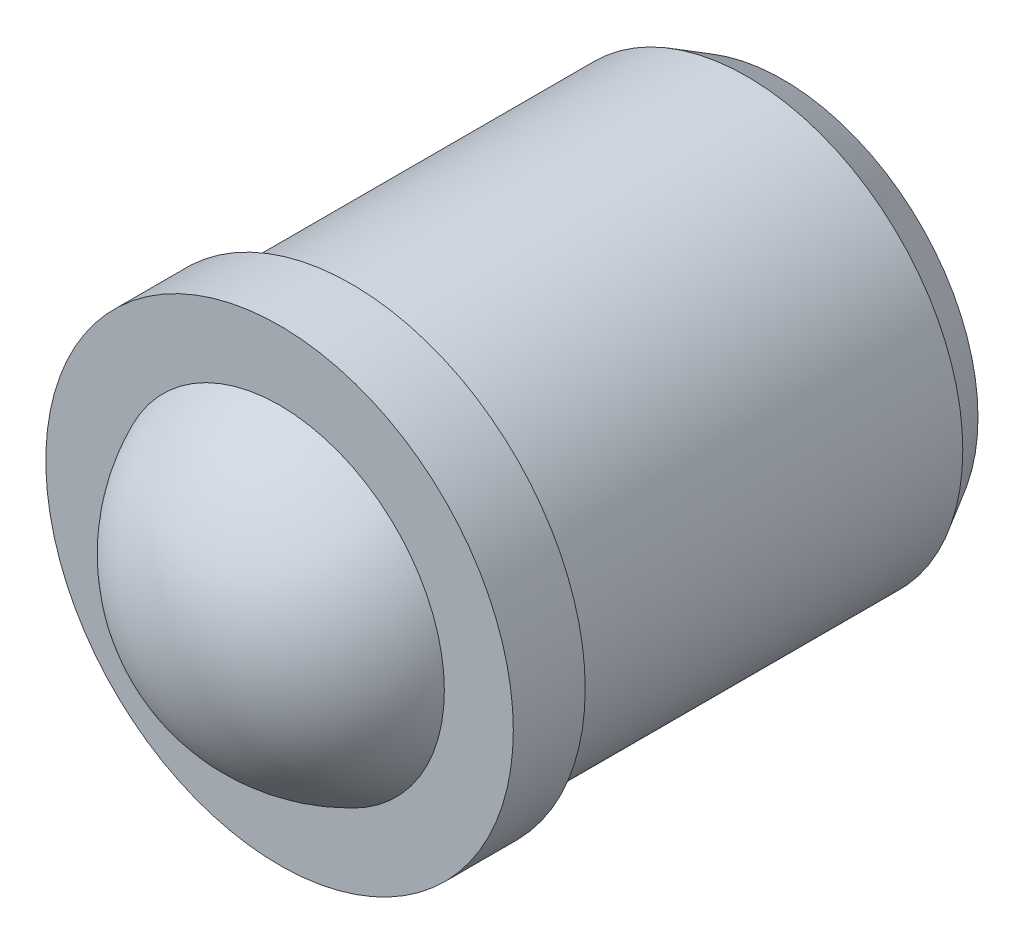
ISO-10303-21;
HEADER;
FILE_DESCRIPTION(('STEP AP214'),'2;1');
FILE_NAME('part.step','',(''),(''),'','','');
FILE_SCHEMA(('AUTOMOTIVE_DESIGN { 1 0 10303 214 1 1 1 1 }'));
ENDSEC;
DATA;
#1=APPLICATION_CONTEXT('core data for automotive mechanical design processes');
#2=APPLICATION_PROTOCOL_DEFINITION('international standard','automotive_design',2000,#1);
#3=PRODUCT_CONTEXT('',#1,'mechanical');
#4=PRODUCT('Part','Part','',(#3));
#5=PRODUCT_RELATED_PRODUCT_CATEGORY('part','',(#4));
#6=PRODUCT_DEFINITION_FORMATION('','',#4);
#7=PRODUCT_DEFINITION_CONTEXT('part definition',#1,'design');
#8=PRODUCT_DEFINITION('design','',#6,#7);
#9=PRODUCT_DEFINITION_SHAPE('','',#8);
#10=(LENGTH_UNIT() NAMED_UNIT(*) SI_UNIT(.MILLI.,.METRE.));
#11=(NAMED_UNIT(*) PLANE_ANGLE_UNIT() SI_UNIT($,.RADIAN.));
#12=(NAMED_UNIT(*) SI_UNIT($,.STERADIAN.) SOLID_ANGLE_UNIT());
#13=UNCERTAINTY_MEASURE_WITH_UNIT(LENGTH_MEASURE(1.E-05),#10,'distance_accuracy_value','');
#14=(GEOMETRIC_REPRESENTATION_CONTEXT(3) GLOBAL_UNCERTAINTY_ASSIGNED_CONTEXT((#13)) GLOBAL_UNIT_ASSIGNED_CONTEXT((#10,
#11,#12)) REPRESENTATION_CONTEXT('',''));
#15=CARTESIAN_POINT('',(0.,0.,0.));
#16=DIRECTION('',(0.,0.,1.));
#17=DIRECTION('',(1.,0.,0.));
#18=AXIS2_PLACEMENT_3D('',#15,#16,#17);
#19=CARTESIAN_POINT('',(0.,0.,0.));
#20=DIRECTION('',(1.,0.,0.));
#21=DIRECTION('',(0.,0.,-1.));
#22=AXIS2_PLACEMENT_3D('',#19,#20,#21);
#23=SPHERICAL_SURFACE('',#22,2.5);
#24=CARTESIAN_POINT('',(0.,0.,0.));
#25=DIRECTION('',(0.,0.,1.));
#26=DIRECTION('',(1.,0.,0.));
#27=AXIS2_PLACEMENT_3D('',#24,#25,#26);
#28=SPHERICAL_SURFACE('',#27,2.5);
#29=CARTESIAN_POINT('',(0.,0.,1.));
#30=DIRECTION('',(0.,0.,1.));
#31=DIRECTION('',(1.,0.,0.));
#32=AXIS2_PLACEMENT_3D('',#29,#30,#31);
#33=CIRCLE('',#32,2.29128784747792);
#34=CARTESIAN_POINT('',(2.29128784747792,0.,1.));
#35=VERTEX_POINT('',#34);
#36=EDGE_CURVE('E35',#35,#35,#33,.T.);
#37=ORIENTED_EDGE('',*,*,#36,.T.);
#38=EDGE_LOOP('',(#37));
#39=FACE_BOUND('',#38,.T.);
#40=ADVANCED_FACE('F12',(#39),#28,.T.);
#41=CARTESIAN_POINT('',(0.,0.,-6.));
#42=DIRECTION('',(0.,0.,1.));
#43=DIRECTION('',(1.,0.,0.));
#44=AXIS2_PLACEMENT_3D('',#41,#42,#43);
#45=PLANE('',#44);
#46=CARTESIAN_POINT('',(0.,0.,-6.));
#47=DIRECTION('',(0.,0.,1.));
#48=DIRECTION('',(1.,0.,0.));
#49=AXIS2_PLACEMENT_3D('',#46,#47,#48);
#50=CIRCLE('',#49,2.71132486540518);
#51=CARTESIAN_POINT('',(2.71132486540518,0.,-6.));
#52=VERTEX_POINT('',#51);
#53=EDGE_CURVE('E8',#52,#52,#50,.F.);
#54=ORIENTED_EDGE('',*,*,#53,.T.);
#55=EDGE_LOOP('',(#54));
#56=FACE_BOUND('',#55,.T.);
#57=ADVANCED_FACE('F60',(#56),#45,.F.);
#58=CARTESIAN_POINT('',(0.,0.,5.));
#59=DIRECTION('',(0.,0.,1.));
#60=DIRECTION('',(1.,0.,0.));
#61=AXIS2_PLACEMENT_3D('',#58,#59,#60);
#62=CYLINDRICAL_SURFACE('',#61,3.);
#63=CARTESIAN_POINT('',(0.,0.,-5.5));
#64=DIRECTION('',(0.,0.,1.));
#65=DIRECTION('',(1.,0.,0.));
#66=AXIS2_PLACEMENT_3D('',#63,#64,#65);
#67=CIRCLE('',#66,3.);
#68=CARTESIAN_POINT('',(3.,0.,-5.5));
#69=VERTEX_POINT('',#68);
#70=EDGE_CURVE('E19',#69,#69,#67,.T.);
#71=ORIENTED_EDGE('',*,*,#70,.T.);
#72=EDGE_LOOP('',(#71));
#73=FACE_BOUND('',#72,.T.);
#74=CARTESIAN_POINT('',(0.,0.,0.));
#75=DIRECTION('',(0.,0.,1.));
#76=DIRECTION('',(1.,0.,0.));
#77=AXIS2_PLACEMENT_3D('',#74,#75,#76);
#78=CIRCLE('',#77,3.);
#79=CARTESIAN_POINT('',(3.,0.,0.));
#80=VERTEX_POINT('',#79);
#81=EDGE_CURVE('E23',#80,#80,#78,.T.);
#82=ORIENTED_EDGE('',*,*,#81,.F.);
#83=EDGE_LOOP('',(#82));
#84=FACE_BOUND('',#83,.T.);
#85=ADVANCED_FACE('F55',(#73,#84),#62,.T.);
#86=CARTESIAN_POINT('',(0.,3.,0.));
#87=DIRECTION('',(0.,0.,1.));
#88=DIRECTION('',(1.,0.,0.));
#89=AXIS2_PLACEMENT_3D('',#86,#87,#88);
#90=PLANE('',#89);
#91=CARTESIAN_POINT('',(0.,0.,0.));
#92=DIRECTION('',(0.,0.,1.));
#93=DIRECTION('',(1.,0.,0.));
#94=AXIS2_PLACEMENT_3D('',#91,#92,#93);
#95=CIRCLE('',#94,3.25);
#96=CARTESIAN_POINT('',(3.25,0.,0.));
#97=VERTEX_POINT('',#96);
#98=EDGE_CURVE('E27',#97,#97,#95,.T.);
#99=ORIENTED_EDGE('',*,*,#98,.F.);
#100=EDGE_LOOP('',(#99));
#101=FACE_BOUND('',#100,.T.);
#102=ORIENTED_EDGE('',*,*,#81,.T.);
#103=EDGE_LOOP('',(#102));
#104=FACE_BOUND('',#103,.T.);
#105=ADVANCED_FACE('F49',(#101,#104),#90,.F.);
#106=CARTESIAN_POINT('',(0.,0.,5.));
#107=DIRECTION('',(0.,0.,1.));
#108=DIRECTION('',(1.,0.,0.));
#109=AXIS2_PLACEMENT_3D('',#106,#107,#108);
#110=CYLINDRICAL_SURFACE('',#109,3.25);
#111=CARTESIAN_POINT('',(0.,0.,1.));
#112=DIRECTION('',(0.,0.,1.));
#113=DIRECTION('',(1.,0.,0.));
#114=AXIS2_PLACEMENT_3D('',#111,#112,#113);
#115=CIRCLE('',#114,3.25);
#116=CARTESIAN_POINT('',(3.25,0.,1.));
#117=VERTEX_POINT('',#116);
#118=EDGE_CURVE('E32',#117,#117,#115,.T.);
#119=ORIENTED_EDGE('',*,*,#118,.F.);
#120=EDGE_LOOP('',(#119));
#121=FACE_BOUND('',#120,.T.);
#122=ORIENTED_EDGE('',*,*,#98,.T.);
#123=EDGE_LOOP('',(#122));
#124=FACE_BOUND('',#123,.T.);
#125=ADVANCED_FACE('F43',(#121,#124),#110,.T.);
#126=CARTESIAN_POINT('',(0.,3.25,1.));
#127=DIRECTION('',(0.,0.,-1.));
#128=DIRECTION('',(-1.,0.,0.));
#129=AXIS2_PLACEMENT_3D('',#126,#127,#128);
#130=PLANE('',#129);
#131=ORIENTED_EDGE('',*,*,#36,.F.);
#132=EDGE_LOOP('',(#131));
#133=FACE_BOUND('',#132,.T.);
#134=ORIENTED_EDGE('',*,*,#118,.T.);
#135=EDGE_LOOP('',(#134));
#136=FACE_BOUND('',#135,.T.);
#137=ADVANCED_FACE('F40',(#133,#136),#130,.F.);
#138=CARTESIAN_POINT('',(0.,0.,-5.5));
#139=DIRECTION('',(0.,0.,1.));
#140=DIRECTION('',(1.,0.,0.));
#141=AXIS2_PLACEMENT_3D('',#138,#139,#140);
#142=CONICAL_SURFACE('',#141,3.,0.523598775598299);
#143=ORIENTED_EDGE('',*,*,#53,.F.);
#144=EDGE_LOOP('',(#143));
#145=FACE_BOUND('',#144,.T.);
#146=ORIENTED_EDGE('',*,*,#70,.F.);
#147=EDGE_LOOP('',(#146));
#148=FACE_BOUND('',#147,.T.);
#149=ADVANCED_FACE('F14',(#145,#148),#142,.T.);
#150=CLOSED_SHELL('',(#40,#57,#85,#105,#125,#137,#149));
#151=MANIFOLD_SOLID_BREP('B1',#150);
#152=ADVANCED_BREP_SHAPE_REPRESENTATION('',(#18,#151),#14);
#153=SHAPE_DEFINITION_REPRESENTATION(#9,#152);
ENDSEC;
END-ISO-10303-21;
